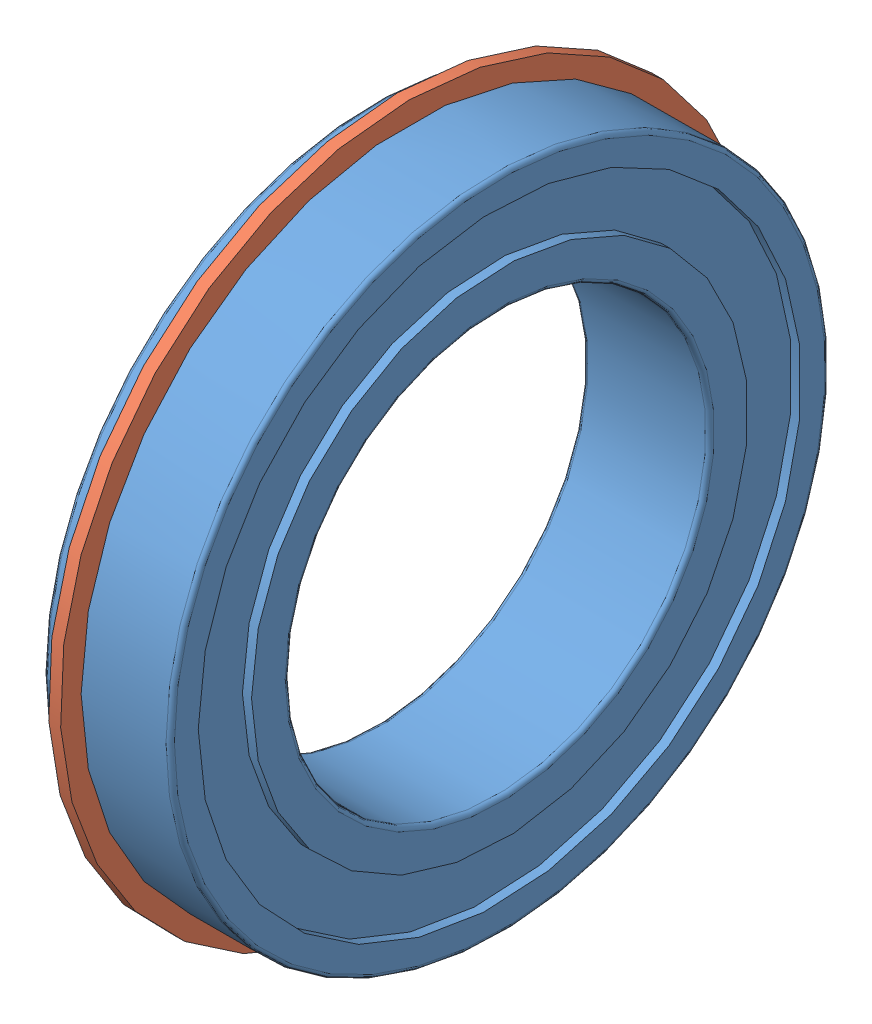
SolidWorks assembly B6906ZZNR.sldasm, configuration Default (file format 5000). Lengths in mm.
Overall size (9 49.71 49.8).
2 component instances, 2 part files, 0 mates.
Components (placement in the parent):
- bearingB6906ZZNR-1: bearingB6906ZZNR.sldprt [Default] at origin size (9 47 47)
- RING-6906ZZ-1: RING-6906ZZ.sldprt [Default] at (1.7 0 0) x (0 0 -1) z (1 0 0) size (49.8 49.71 0.85)
